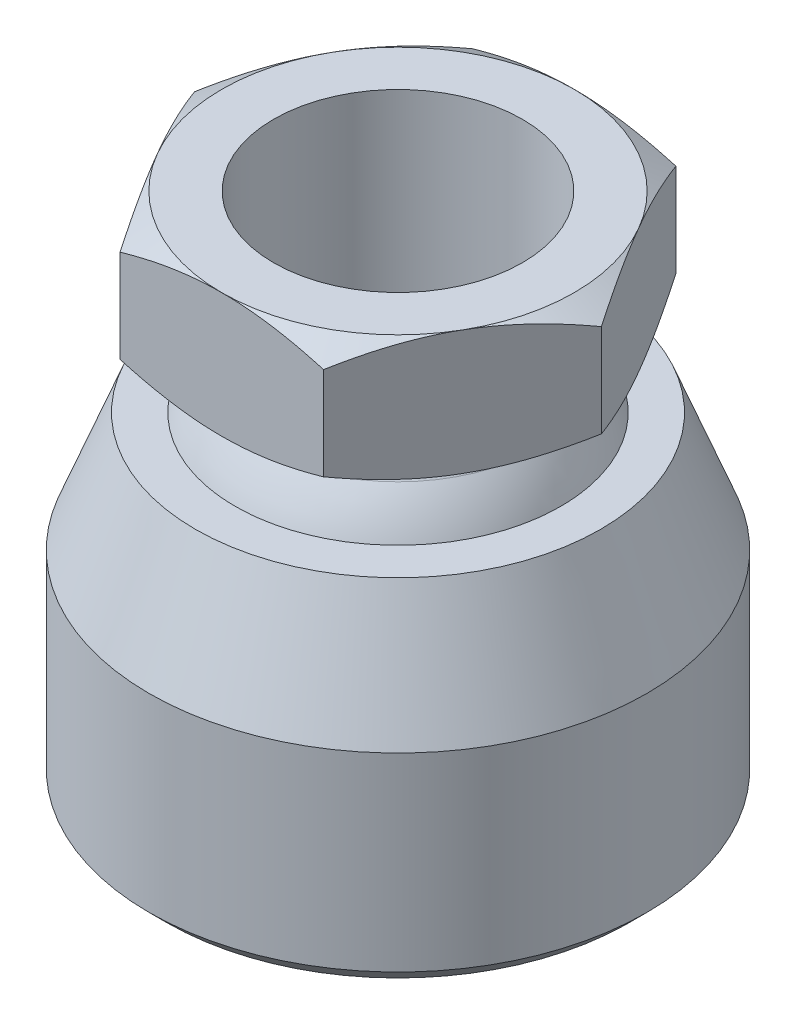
ISO-10303-21;
HEADER;
FILE_DESCRIPTION(('STEP AP214'),'2;1');
FILE_NAME('part.step','',(''),(''),'','','');
FILE_SCHEMA(('AUTOMOTIVE_DESIGN { 1 0 10303 214 1 1 1 1 }'));
ENDSEC;
DATA;
#1=APPLICATION_CONTEXT('core data for automotive mechanical design processes');
#2=APPLICATION_PROTOCOL_DEFINITION('international standard','automotive_design',2000,#1);
#3=PRODUCT_CONTEXT('',#1,'mechanical');
#4=PRODUCT('Part','Part','',(#3));
#5=PRODUCT_RELATED_PRODUCT_CATEGORY('part','',(#4));
#6=PRODUCT_DEFINITION_FORMATION('','',#4);
#7=PRODUCT_DEFINITION_CONTEXT('part definition',#1,'design');
#8=PRODUCT_DEFINITION('design','',#6,#7);
#9=PRODUCT_DEFINITION_SHAPE('','',#8);
#10=(LENGTH_UNIT() NAMED_UNIT(*) SI_UNIT(.MILLI.,.METRE.));
#11=(NAMED_UNIT(*) PLANE_ANGLE_UNIT() SI_UNIT($,.RADIAN.));
#12=(NAMED_UNIT(*) SI_UNIT($,.STERADIAN.) SOLID_ANGLE_UNIT());
#13=UNCERTAINTY_MEASURE_WITH_UNIT(LENGTH_MEASURE(1.E-05),#10,'distance_accuracy_value','');
#14=(GEOMETRIC_REPRESENTATION_CONTEXT(3) GLOBAL_UNCERTAINTY_ASSIGNED_CONTEXT((#13)) GLOBAL_UNIT_ASSIGNED_CONTEXT((#10,
#11,#12)) REPRESENTATION_CONTEXT('',''));
#15=CARTESIAN_POINT('',(0.,0.,0.));
#16=DIRECTION('',(0.,0.,1.));
#17=DIRECTION('',(1.,0.,0.));
#18=AXIS2_PLACEMENT_3D('',#15,#16,#17);
#19=CARTESIAN_POINT('',(0.,0.,0.));
#20=DIRECTION('',(-1.,0.,0.));
#21=DIRECTION('',(0.,1.,0.));
#22=AXIS2_PLACEMENT_3D('',#19,#20,#21);
#23=SPHERICAL_SURFACE('',#22,8.5);
#24=CARTESIAN_POINT('',(0.,0.,0.));
#25=DIRECTION('',(0.,-1.,0.));
#26=DIRECTION('',(0.,0.,-1.));
#27=AXIS2_PLACEMENT_3D('',#24,#25,#26);
#28=SPHERICAL_SURFACE('',#27,8.5);
#29=CARTESIAN_POINT('',(0.,5.13636363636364,0.));
#30=DIRECTION('',(0.,-1.,0.));
#31=DIRECTION('',(0.,0.,-1.));
#32=AXIS2_PLACEMENT_3D('',#29,#30,#31);
#33=CIRCLE('',#32,6.77257473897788);
#34=CARTESIAN_POINT('',(0.,5.13636363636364,-6.77257473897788));
#35=VERTEX_POINT('',#34);
#36=EDGE_CURVE('P0_E273',#35,#35,#33,.T.);
#37=ORIENTED_EDGE('',*,*,#36,.T.);
#38=EDGE_LOOP('',(#37));
#39=FACE_BOUND('',#38,.T.);
#40=ADVANCED_FACE('P0_F16',(#39),#28,.T.);
#41=CARTESIAN_POINT('',(-4.90747728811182,6.5,8.5));
#42=DIRECTION('',(0.,1.,0.));
#43=DIRECTION('',(0.,0.,1.));
#44=AXIS2_PLACEMENT_3D('',#41,#42,#43);
#45=PLANE('',#44);
#46=CARTESIAN_POINT('',(0.,6.5,0.));
#47=DIRECTION('',(0.,1.,0.));
#48=DIRECTION('',(0.,0.,1.));
#49=AXIS2_PLACEMENT_3D('',#46,#47,#48);
#50=CIRCLE('',#49,7.44983221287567);
#51=CARTESIAN_POINT('',(0.,6.5,7.44983221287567));
#52=VERTEX_POINT('',#51);
#53=EDGE_CURVE('P0_E270',#52,#52,#50,.T.);
#54=ORIENTED_EDGE('',*,*,#53,.T.);
#55=EDGE_LOOP('',(#54));
#56=FACE_BOUND('',#55,.T.);
#57=CARTESIAN_POINT('',(0.,6.5,0.));
#58=DIRECTION('',(0.,1.,0.));
#59=DIRECTION('',(0.,0.,1.));
#60=AXIS2_PLACEMENT_3D('',#57,#58,#59);
#61=CIRCLE('',#60,8.5);
#62=CARTESIAN_POINT('',(0.,6.5,8.5));
#63=VERTEX_POINT('',#62);
#64=CARTESIAN_POINT('',(7.36121593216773,6.5,4.25));
#65=VERTEX_POINT('',#64);
#66=EDGE_CURVE('P0_E317',#63,#65,#61,.T.);
#67=ORIENTED_EDGE('',*,*,#66,.F.);
#68=CARTESIAN_POINT('',(-7.36121593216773,6.5,4.25));
#69=VERTEX_POINT('',#68);
#70=EDGE_CURVE('P0_E322',#69,#63,#61,.T.);
#71=ORIENTED_EDGE('',*,*,#70,.F.);
#72=CARTESIAN_POINT('',(-7.36121593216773,6.5,-4.25));
#73=VERTEX_POINT('',#72);
#74=EDGE_CURVE('P0_E318',#73,#69,#61,.T.);
#75=ORIENTED_EDGE('',*,*,#74,.F.);
#76=CARTESIAN_POINT('',(0.,6.5,-8.5));
#77=VERTEX_POINT('',#76);
#78=EDGE_CURVE('P0_E36',#77,#73,#61,.T.);
#79=ORIENTED_EDGE('',*,*,#78,.F.);
#80=CARTESIAN_POINT('',(7.36121593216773,6.5,-4.25));
#81=VERTEX_POINT('',#80);
#82=EDGE_CURVE('P0_E44',#81,#77,#61,.T.);
#83=ORIENTED_EDGE('',*,*,#82,.F.);
#84=EDGE_CURVE('P0_E314',#65,#81,#61,.T.);
#85=ORIENTED_EDGE('',*,*,#84,.F.);
#86=EDGE_LOOP('',(#67,#71,#75,#79,#83,#85));
#87=FACE_BOUND('',#86,.T.);
#88=ADVANCED_FACE('P0_F132',(#56,#87),#45,.F.);
#89=CARTESIAN_POINT('',(0.,5.65,0.));
#90=DIRECTION('',(0.,1.,0.));
#91=DIRECTION('',(0.,0.,1.));
#92=AXIS2_PLACEMENT_3D('',#89,#90,#91);
#93=TOROIDAL_SURFACE('',#92,7.44983221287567,0.85);
#94=ORIENTED_EDGE('',*,*,#36,.F.);
#95=EDGE_LOOP('',(#94));
#96=FACE_BOUND('',#95,.T.);
#97=ORIENTED_EDGE('',*,*,#53,.F.);
#98=EDGE_LOOP('',(#97));
#99=FACE_BOUND('',#98,.T.);
#100=ADVANCED_FACE('P0_F18',(#96,#99),#93,.F.);
#101=CARTESIAN_POINT('',(0.,6.5,0.));
#102=DIRECTION('',(0.,1.,0.));
#103=DIRECTION('',(0.,0.,1.));
#104=AXIS2_PLACEMENT_3D('',#101,#102,#103);
#105=CONICAL_SURFACE('',#104,8.5,1.0471975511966);
#106=CARTESIAN_POINT('',(-4.90736181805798,7.25925604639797,8.5002));
#107=CARTESIAN_POINT('',(-5.01523349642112,7.19698613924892,8.31336077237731));
#108=CARTESIAN_POINT('',(-5.1235073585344,7.13754229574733,8.1258249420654));
#109=CARTESIAN_POINT('',(-5.34093440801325,7.02508511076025,7.74923024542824));
#110=CARTESIAN_POINT('',(-5.45008795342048,6.97207454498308,7.56017075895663));
#111=CARTESIAN_POINT('',(-5.77929626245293,6.82373338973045,6.9899652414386));
#112=CARTESIAN_POINT('',(-6.00065055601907,6.73935892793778,6.60656835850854));
#113=CARTESIAN_POINT('',(-6.33190297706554,6.64042001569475,6.03282233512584));
#114=CARTESIAN_POINT('',(-6.44081150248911,6.61223519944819,5.84418723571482));
#115=CARTESIAN_POINT('',(-6.65912106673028,6.5649740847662,5.46606397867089));
#116=CARTESIAN_POINT('',(-6.76852206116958,6.54589698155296,5.27657589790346));
#117=CARTESIAN_POINT('',(-6.98751241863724,6.5173347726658,4.8972734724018));
#118=CARTESIAN_POINT('',(-7.09710142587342,6.50783878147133,4.70745974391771));
#119=CARTESIAN_POINT('',(-7.31638067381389,6.49864237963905,4.32765694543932));
#120=CARTESIAN_POINT('',(-7.42607091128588,6.49894166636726,4.13766788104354));
#121=CARTESIAN_POINT('',(-7.63114046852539,6.50865447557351,3.78247698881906));
#122=CARTESIAN_POINT('',(-7.72653426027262,6.51688316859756,3.6172500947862));
#123=CARTESIAN_POINT('',(-7.9170984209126,6.5405892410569,3.28718328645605));
#124=CARTESIAN_POINT('',(-8.01226877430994,6.5560671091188,3.12234339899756));
#125=CARTESIAN_POINT('',(-8.29741139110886,6.61300862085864,2.62846189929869));
#126=CARTESIAN_POINT('',(-8.48687892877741,6.66497306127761,2.30029449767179));
#127=CARTESIAN_POINT('',(-8.86782383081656,6.79488494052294,1.64047857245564));
#128=CARTESIAN_POINT('',(-9.05925257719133,6.87338306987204,1.30891425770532));
#129=CARTESIAN_POINT('',(-9.43925537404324,7.05154133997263,0.650730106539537));
#130=CARTESIAN_POINT('',(-9.62783429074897,7.15115963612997,0.32410184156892));
#131=CARTESIAN_POINT('',(-9.81507004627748,7.25925604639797,-0.000200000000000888));
#132=B_SPLINE_CURVE_WITH_KNOTS('',3,(#106,#107,#108,#109,#110,#111,#112,#113,#114,#115,#116,
#117,#118,#119,#120,#121,#122,#123,#124,#125,#126,#127,#128,#129,#130,#131),.UNSPECIFIED.,.F.,
.F.,(4,2,2,2,2,2,2,2,2,2,2,2,4),(0.,0.673596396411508,1.34748239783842,2.69805431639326,
3.356799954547,4.01548737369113,4.67342558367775,5.33134346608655,5.90409556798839,
6.47688628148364,7.62328361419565,8.79510569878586,9.96462743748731),.UNSPECIFIED.);
#133=CARTESIAN_POINT('',(-4.90747728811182,7.25918937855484,8.5));
#134=VERTEX_POINT('',#133);
#135=EDGE_CURVE('P0_E167',#134,#69,#132,.T.);
#136=ORIENTED_EDGE('',*,*,#135,.T.);
#137=ORIENTED_EDGE('',*,*,#70,.T.);
#138=CARTESIAN_POINT('',(-13.3287339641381,10.7195001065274,8.5));
#139=CARTESIAN_POINT('',(-12.9562370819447,10.5382209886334,8.5));
#140=CARTESIAN_POINT('',(-12.58290072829,10.3586380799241,8.5));
#141=CARTESIAN_POINT('',(-11.8341032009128,10.0038157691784,8.5));
#142=CARTESIAN_POINT('',(-11.4586417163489,9.82857702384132,8.5));
#143=CARTESIAN_POINT('',(-10.7032828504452,9.48254356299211,8.5));
#144=CARTESIAN_POINT('',(-10.3233725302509,9.3117769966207,8.5));
#145=CARTESIAN_POINT('',(-9.56058129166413,8.97703859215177,8.5));
#146=CARTESIAN_POINT('',(-9.17770051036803,8.81306644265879,8.5));
#147=CARTESIAN_POINT('',(-8.39542942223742,8.48833842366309,8.5));
#148=CARTESIAN_POINT('',(-7.99591671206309,8.3278758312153,8.5));
#149=CARTESIAN_POINT('',(-7.19227261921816,8.01874365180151,8.5));
#150=CARTESIAN_POINT('',(-6.7881407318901,7.8700753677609,8.5));
#151=CARTESIAN_POINT('',(-5.97532072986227,7.58832803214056,8.5));
#152=CARTESIAN_POINT('',(-5.56664324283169,7.45521864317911,8.5));
#153=CARTESIAN_POINT('',(-4.74344164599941,7.20876184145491,8.5));
#154=CARTESIAN_POINT('',(-4.32891937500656,7.09540835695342,8.5));
#155=CARTESIAN_POINT('',(-3.49606577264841,6.89442587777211,8.5));
#156=CARTESIAN_POINT('',(-3.0777704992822,6.80665143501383,8.5));
#157=CARTESIAN_POINT('',(-2.44640359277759,6.697894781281,8.5));
#158=CARTESIAN_POINT('',(-2.23527946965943,6.6654586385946,8.5));
#159=CARTESIAN_POINT('',(-1.81193270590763,6.60885379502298,8.5));
#160=CARTESIAN_POINT('',(-1.59971017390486,6.58468429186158,8.5));
#161=CARTESIAN_POINT('',(-1.17728694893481,6.54540520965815,8.5));
#162=CARTESIAN_POINT('',(-0.967097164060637,6.5301788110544,8.5));
#163=CARTESIAN_POINT('',(-0.546261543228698,6.50863500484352,8.5));
#164=CARTESIAN_POINT('',(-0.335615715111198,6.50231744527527,8.5));
#165=CARTESIAN_POINT('',(0.0857542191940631,6.49874262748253,8.5));
#166=CARTESIAN_POINT('',(0.296478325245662,6.50148535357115,8.5));
#167=CARTESIAN_POINT('',(0.71761992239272,6.51596220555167,8.5));
#168=CARTESIAN_POINT('',(0.928037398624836,6.52769675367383,8.5));
#169=CARTESIAN_POINT('',(1.42936405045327,6.56611453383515,8.5));
#170=CARTESIAN_POINT('',(1.71997183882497,6.59682098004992,8.5));
#171=CARTESIAN_POINT('',(2.29911211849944,6.6737427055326,8.5));
#172=CARTESIAN_POINT('',(2.58764433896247,6.71995997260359,8.5));
#173=CARTESIAN_POINT('',(3.44975299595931,6.8794342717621,8.5));
#174=CARTESIAN_POINT('',(4.01953804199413,7.01348739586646,8.5));
#175=CARTESIAN_POINT('',(4.87169925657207,7.24698847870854,8.5));
#176=CARTESIAN_POINT('',(5.15846773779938,7.33133812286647,8.5));
#177=CARTESIAN_POINT('',(5.72922231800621,7.50906078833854,8.5));
#178=CARTESIAN_POINT('',(6.01320839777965,7.60243387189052,8.5));
#179=CARTESIAN_POINT('',(6.57848220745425,7.79668365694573,8.5));
#180=CARTESIAN_POINT('',(6.85977072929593,7.89755807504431,8.5));
#181=CARTESIAN_POINT('',(7.41999995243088,8.10559759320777,8.5));
#182=CARTESIAN_POINT('',(7.69894068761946,8.21276260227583,8.5));
#183=CARTESIAN_POINT('',(8.38072209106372,8.48211898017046,8.5));
#184=CARTESIAN_POINT('',(8.78240648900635,8.64723241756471,8.5));
#185=CARTESIAN_POINT('',(9.58213824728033,8.98607130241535,8.5));
#186=CARTESIAN_POINT('',(9.98018533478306,9.15979738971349,8.5));
#187=CARTESIAN_POINT('',(10.7733585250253,9.51405671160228,8.5));
#188=CARTESIAN_POINT('',(11.1684838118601,9.69459176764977,8.5));
#189=CARTESIAN_POINT('',(11.9562185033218,10.0610285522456,8.5));
#190=CARTESIAN_POINT('',(12.348827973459,10.2469301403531,8.5));
#191=CARTESIAN_POINT('',(13.132459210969,10.6232879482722,8.5));
#192=CARTESIAN_POINT('',(13.5234783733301,10.8137495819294,8.5));
#193=CARTESIAN_POINT('',(14.3037813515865,11.1981948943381,8.5));
#194=CARTESIAN_POINT('',(14.6930651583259,11.3921785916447,8.5));
#195=CARTESIAN_POINT('',(15.4701152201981,11.7830098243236,8.5));
#196=CARTESIAN_POINT('',(15.8578817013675,11.9798569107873,8.5));
#197=CARTESIAN_POINT('',(16.6321842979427,12.375957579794,8.5));
#198=CARTESIAN_POINT('',(17.0187204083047,12.5752111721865,8.5));
#199=CARTESIAN_POINT('',(18.107429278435,13.140012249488,8.5));
#200=CARTESIAN_POINT('',(18.8083971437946,13.5078820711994,8.5));
#201=CARTESIAN_POINT('',(20.2077532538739,14.2485558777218,8.5));
#202=CARTESIAN_POINT('',(20.9061413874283,14.6213600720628,8.49999999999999));
#203=CARTESIAN_POINT('',(22.2989609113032,15.3696602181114,8.49999999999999));
#204=CARTESIAN_POINT('',(22.9933979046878,15.7451457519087,8.49999999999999));
#205=CARTESIAN_POINT('',(24.380634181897,16.4990285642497,8.49999999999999));
#206=CARTESIAN_POINT('',(25.073433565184,16.8774256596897,8.49999999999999));
#207=CARTESIAN_POINT('',(25.7656380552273,17.2568995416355,8.49999999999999));
#208=B_SPLINE_CURVE_WITH_KNOTS('',3,(#138,#139,#140,#141,#142,#143,#144,#145,#146,#147,#148,
#149,#150,#151,#152,#153,#154,#155,#156,#157,#158,#159,#160,#161,#162,#163,#164,#165,#166,#167,
#168,#169,#170,#171,#172,#173,#174,#175,#176,#177,#178,#179,#180,#181,#182,#183,#184,#185,#186,
#187,#188,#189,#190,#191,#192,#193,#194,#195,#196,#197,#198,#199,#200,#201,#202,#203,#204,#205,
#206,#207),.UNSPECIFIED.,.F.,.F.,(4,2,2,2,2,2,2,2,2,2,2,2,2,2,2,2,2,2,2,2,2,2,2,2,2,2,2,2,2,2,2,
2,2,2,4),(0.,1.24281148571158,2.48580971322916,3.73533130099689,4.98479555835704,
6.27624989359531,7.56784669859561,8.85688153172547,10.1455194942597,11.4266802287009,
12.0673477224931,12.7079530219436,13.3399927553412,13.972021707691,14.6040495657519,
15.236107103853,16.1122916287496,16.988588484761,18.742091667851,19.638762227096,
20.5354389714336,21.431843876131,22.3282358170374,23.6309839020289,24.9338289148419,
26.2370249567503,27.5401869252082,28.8449813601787,30.1497826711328,31.4543815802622,
32.7589858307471,35.1338574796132,37.5088302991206,39.8771739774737,42.2453699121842),.UNSPECIFIED.);
#209=EDGE_CURVE('P0_E20',#63,#134,#208,.F.);
#210=ORIENTED_EDGE('',*,*,#209,.T.);
#211=EDGE_LOOP('',(#136,#137,#210));
#212=FACE_BOUND('',#211,.T.);
#213=ADVANCED_FACE('P0_F181',(#212),#105,.T.);
#214=CARTESIAN_POINT('',(9.81507004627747,7.25925604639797,-0.000199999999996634));
#215=CARTESIAN_POINT('',(9.70719836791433,7.19698613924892,0.186639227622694));
#216=CARTESIAN_POINT('',(9.59892450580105,7.13754229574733,0.3741750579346));
#217=CARTESIAN_POINT('',(9.3814974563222,7.02508511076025,0.750769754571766));
#218=CARTESIAN_POINT('',(9.27234391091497,6.97207454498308,0.93982924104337));
#219=CARTESIAN_POINT('',(8.94313560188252,6.82373338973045,1.5100347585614));
#220=CARTESIAN_POINT('',(8.72178130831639,6.73935892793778,1.89343164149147));
#221=CARTESIAN_POINT('',(8.39052888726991,6.64042001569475,2.46717766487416));
#222=CARTESIAN_POINT('',(8.28162036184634,6.61223519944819,2.65581276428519));
#223=CARTESIAN_POINT('',(8.06331079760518,6.5649740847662,3.03393602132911));
#224=CARTESIAN_POINT('',(7.95390980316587,6.54589698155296,3.22342410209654));
#225=CARTESIAN_POINT('',(7.73491944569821,6.5173347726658,3.6027265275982));
#226=CARTESIAN_POINT('',(7.62533043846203,6.50783878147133,3.79254025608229));
#227=CARTESIAN_POINT('',(7.40605119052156,6.49864237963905,4.17234305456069));
#228=CARTESIAN_POINT('',(7.29636095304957,6.49894166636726,4.36233211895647));
#229=CARTESIAN_POINT('',(7.09129139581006,6.50865447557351,4.71752301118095));
#230=CARTESIAN_POINT('',(6.99589760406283,6.51688316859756,4.8827499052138));
#231=CARTESIAN_POINT('',(6.80533344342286,6.54058924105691,5.21281671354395));
#232=CARTESIAN_POINT('',(6.71016309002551,6.5560671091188,5.37765660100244));
#233=CARTESIAN_POINT('',(6.42502047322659,6.61300862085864,5.87153810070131));
#234=CARTESIAN_POINT('',(6.23555293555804,6.66497306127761,6.19970550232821));
#235=CARTESIAN_POINT('',(5.8546080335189,6.79488494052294,6.85952142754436));
#236=CARTESIAN_POINT('',(5.66317928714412,6.87338306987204,7.19108574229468));
#237=CARTESIAN_POINT('',(5.28317649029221,7.05154133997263,7.84926989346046));
#238=CARTESIAN_POINT('',(5.09459757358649,7.15115963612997,8.17589815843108));
#239=CARTESIAN_POINT('',(4.90736181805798,7.25925604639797,8.5002));
#240=B_SPLINE_CURVE_WITH_KNOTS('',3,(#214,#215,#216,#217,#218,#219,#220,#221,#222,#223,#224,
#225,#226,#227,#228,#229,#230,#231,#232,#233,#234,#235,#236,#237,#238,#239),.UNSPECIFIED.,.F.,
.F.,(4,2,2,2,2,2,2,2,2,2,2,2,4),(0.,0.673596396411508,1.34748239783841,2.69805431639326,
3.356799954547,4.01548737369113,4.67342558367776,5.33134346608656,5.90409556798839,
6.47688628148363,7.62328361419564,8.79510569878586,9.96462743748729),.UNSPECIFIED.);
#241=CARTESIAN_POINT('',(4.90747728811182,7.25918937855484,8.5));
#242=VERTEX_POINT('',#241);
#243=EDGE_CURVE('P0_E189',#65,#242,#240,.T.);
#244=ORIENTED_EDGE('',*,*,#243,.T.);
#245=EDGE_CURVE('P0_E11',#242,#63,#208,.F.);
#246=ORIENTED_EDGE('',*,*,#245,.T.);
#247=ORIENTED_EDGE('',*,*,#66,.T.);
#248=EDGE_LOOP('',(#244,#246,#247));
#249=FACE_BOUND('',#248,.T.);
#250=ADVANCED_FACE('P0_F177',(#249),#105,.T.);
#251=CARTESIAN_POINT('',(4.90736181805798,7.25925604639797,-8.5002));
#252=CARTESIAN_POINT('',(5.01523349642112,7.19698613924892,-8.31336077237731));
#253=CARTESIAN_POINT('',(5.1235073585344,7.13754229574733,-8.1258249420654));
#254=CARTESIAN_POINT('',(5.34093440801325,7.02508511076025,-7.74923024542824));
#255=CARTESIAN_POINT('',(5.45008795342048,6.97207454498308,-7.56017075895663));
#256=CARTESIAN_POINT('',(5.77929626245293,6.82373338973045,-6.9899652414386));
#257=CARTESIAN_POINT('',(6.00065055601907,6.73935892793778,-6.60656835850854));
#258=CARTESIAN_POINT('',(6.33190297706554,6.64042001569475,-6.03282233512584));
#259=CARTESIAN_POINT('',(6.44081150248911,6.61223519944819,-5.84418723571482));
#260=CARTESIAN_POINT('',(6.65912106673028,6.5649740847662,-5.46606397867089));
#261=CARTESIAN_POINT('',(6.76852206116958,6.54589698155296,-5.27657589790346));
#262=CARTESIAN_POINT('',(6.98751241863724,6.5173347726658,-4.8972734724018));
#263=CARTESIAN_POINT('',(7.09710142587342,6.50783878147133,-4.70745974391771));
#264=CARTESIAN_POINT('',(7.31638067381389,6.49864237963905,-4.32765694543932));
#265=CARTESIAN_POINT('',(7.42607091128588,6.49894166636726,-4.13766788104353));
#266=CARTESIAN_POINT('',(7.63114046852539,6.5086544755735,-3.78247698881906));
#267=CARTESIAN_POINT('',(7.72653426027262,6.51688316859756,-3.6172500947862));
#268=CARTESIAN_POINT('',(7.9170984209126,6.5405892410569,-3.28718328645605));
#269=CARTESIAN_POINT('',(8.01226877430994,6.5560671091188,-3.12234339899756));
#270=CARTESIAN_POINT('',(8.29741139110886,6.61300862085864,-2.62846189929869));
#271=CARTESIAN_POINT('',(8.48687892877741,6.66497306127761,-2.30029449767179));
#272=CARTESIAN_POINT('',(8.86782383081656,6.79488494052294,-1.64047857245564));
#273=CARTESIAN_POINT('',(9.05925257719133,6.87338306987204,-1.30891425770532));
#274=CARTESIAN_POINT('',(9.43925537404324,7.05154133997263,-0.650730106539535));
#275=CARTESIAN_POINT('',(9.62783429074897,7.15115963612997,-0.324101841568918));
#276=CARTESIAN_POINT('',(9.81507004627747,7.25925604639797,0.000200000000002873));
#277=B_SPLINE_CURVE_WITH_KNOTS('',3,(#251,#252,#253,#254,#255,#256,#257,#258,#259,#260,#261,
#262,#263,#264,#265,#266,#267,#268,#269,#270,#271,#272,#273,#274,#275,#276),.UNSPECIFIED.,.F.,
.F.,(4,2,2,2,2,2,2,2,2,2,2,2,4),(0.,0.673596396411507,1.34748239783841,2.69805431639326,
3.356799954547,4.01548737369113,4.67342558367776,5.33134346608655,5.90409556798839,
6.47688628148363,7.62328361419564,8.79510569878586,9.96462743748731),.UNSPECIFIED.);
#278=CARTESIAN_POINT('',(9.81495457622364,7.25918937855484,0.));
#279=VERTEX_POINT('',#278);
#280=EDGE_CURVE('P0_E196',#81,#279,#277,.T.);
#281=ORIENTED_EDGE('',*,*,#280,.T.);
#282=EDGE_CURVE('P0_E304',#279,#65,#240,.T.);
#283=ORIENTED_EDGE('',*,*,#282,.T.);
#284=ORIENTED_EDGE('',*,*,#84,.T.);
#285=EDGE_LOOP('',(#281,#283,#284));
#286=FACE_BOUND('',#285,.T.);
#287=ADVANCED_FACE('P0_F180',(#286),#105,.T.);
#288=CARTESIAN_POINT('',(-13.3287339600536,10.7195001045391,-8.5));
#289=CARTESIAN_POINT('',(-12.9562370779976,10.538220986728,-8.5));
#290=CARTESIAN_POINT('',(-12.5829007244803,10.3586380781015,-8.5));
#291=CARTESIAN_POINT('',(-11.8341031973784,10.0038157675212,-8.5));
#292=CARTESIAN_POINT('',(-11.4586417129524,9.82857702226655,-8.5));
#293=CARTESIAN_POINT('',(-10.7032828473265,9.48254356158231,-8.5));
#294=CARTESIAN_POINT('',(-10.3233725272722,9.31177699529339,-8.5));
#295=CARTESIAN_POINT('',(-9.56058128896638,8.97703859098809,-8.5));
#296=CARTESIAN_POINT('',(-9.17770050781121,8.81306644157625,-8.5));
#297=CARTESIAN_POINT('',(-8.3954294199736,8.48833842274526,-8.5));
#298=CARTESIAN_POINT('',(-7.99591670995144,8.32787583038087,-8.5));
#299=CARTESIAN_POINT('',(-7.19227261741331,8.01874365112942,-8.5));
#300=CARTESIAN_POINT('',(-6.78814073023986,7.87007536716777,-8.5));
#301=CARTESIAN_POINT('',(-5.97532072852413,7.58832803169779,-8.5));
#302=CARTESIAN_POINT('',(-5.56664324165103,7.45521864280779,-8.5));
#303=CARTESIAN_POINT('',(-4.74344164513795,7.20876184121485,-8.5));
#304=CARTESIAN_POINT('',(-4.32891937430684,7.09540835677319,-8.5));
#305=CARTESIAN_POINT('',(-3.49606577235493,6.89442587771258,-8.5));
#306=CARTESIAN_POINT('',(-3.07777049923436,6.80665143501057,-8.5));
#307=CARTESIAN_POINT('',(-2.44640359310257,6.69789478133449,-8.5));
#308=CARTESIAN_POINT('',(-2.23527947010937,6.66545863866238,-8.5));
#309=CARTESIAN_POINT('',(-1.81193270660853,6.60885379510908,-8.5));
#310=CARTESIAN_POINT('',(-1.59971017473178,6.58468429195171,-8.5));
#311=CARTESIAN_POINT('',(-1.17728695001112,6.54540520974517,-8.5));
#312=CARTESIAN_POINT('',(-0.967097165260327,6.53017881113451,-8.5));
#313=CARTESIAN_POINT('',(-0.546261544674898,6.50863500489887,-8.5));
#314=CARTESIAN_POINT('',(-0.335615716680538,6.50231744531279,-8.5));
#315=CARTESIAN_POINT('',(0.0857542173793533,6.49874262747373,-8.5));
#316=CARTESIAN_POINT('',(0.296478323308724,6.50148535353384,-8.5));
#317=CARTESIAN_POINT('',(0.717619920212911,6.51596220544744,-8.5));
#318=CARTESIAN_POINT('',(0.928037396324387,6.52769675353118,-8.5));
#319=CARTESIAN_POINT('',(1.42936404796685,6.56611453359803,-8.5));
#320=CARTESIAN_POINT('',(1.71997183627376,6.59682097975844,-8.5));
#321=CARTESIAN_POINT('',(2.29911211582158,6.67374270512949,-8.5));
#322=CARTESIAN_POINT('',(2.58764433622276,6.71995997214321,-8.5));
#323=CARTESIAN_POINT('',(3.44975299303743,6.87943427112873,-8.5));
#324=CARTESIAN_POINT('',(4.0195380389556,7.01348739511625,-8.5));
#325=CARTESIAN_POINT('',(4.87169925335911,7.24698847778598,-8.5));
#326=CARTESIAN_POINT('',(5.15846773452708,7.33133812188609,-8.5));
#327=CARTESIAN_POINT('',(5.72922231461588,7.50906078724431,-8.5));
#328=CARTESIAN_POINT('',(6.01320839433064,7.60243387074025,-8.5));
#329=CARTESIAN_POINT('',(6.57848220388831,7.79668365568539,-8.5));
#330=CARTESIAN_POINT('',(6.85977072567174,7.89755807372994,-8.5));
#331=CARTESIAN_POINT('',(7.41999994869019,8.10559759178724,-8.5));
#332=CARTESIAN_POINT('',(7.69894068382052,8.21276260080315,-8.5));
#333=CARTESIAN_POINT('',(8.38072208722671,8.48211897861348,-8.5));
#334=CARTESIAN_POINT('',(8.78240648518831,8.64723241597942,-8.5));
#335=CARTESIAN_POINT('',(9.58213824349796,8.98607130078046,-8.5));
#336=CARTESIAN_POINT('',(9.9801853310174,9.15979738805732,-8.5));
#337=CARTESIAN_POINT('',(10.7733585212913,9.51405670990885,-8.5));
#338=CARTESIAN_POINT('',(11.1684838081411,9.69459176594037,-8.5));
#339=CARTESIAN_POINT('',(11.9562184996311,10.0610285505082,-8.5));
#340=CARTESIAN_POINT('',(12.3488279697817,10.2469301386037,-8.5));
#341=CARTESIAN_POINT('',(13.1324592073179,10.623287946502,-8.5));
#342=CARTESIAN_POINT('',(13.5234783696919,10.8137495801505,-8.5));
#343=CARTESIAN_POINT('',(14.3037813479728,11.1981948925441,-8.5));
#344=CARTESIAN_POINT('',(14.6930651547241,11.3921785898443,-8.5));
#345=CARTESIAN_POINT('',(15.4701152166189,11.7830098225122,-8.5));
#346=CARTESIAN_POINT('',(15.8578816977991,11.9798569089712,-8.5));
#347=CARTESIAN_POINT('',(16.6321842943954,12.37595757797,-8.5));
#348=CARTESIAN_POINT('',(17.0187204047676,12.5752111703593,-8.5));
#349=CARTESIAN_POINT('',(18.1074292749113,13.1400122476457,-8.5));
#350=CARTESIAN_POINT('',(18.8083971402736,13.5078820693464,-8.5));
#351=CARTESIAN_POINT('',(20.2077532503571,14.2485558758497,-8.5));
#352=CARTESIAN_POINT('',(20.9061413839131,14.6213600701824,-8.5));
#353=CARTESIAN_POINT('',(22.2989609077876,15.3696602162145,-8.5));
#354=CARTESIAN_POINT('',(22.9933979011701,15.7451457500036,-8.5));
#355=CARTESIAN_POINT('',(24.3806341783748,16.4990285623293,-8.5));
#356=CARTESIAN_POINT('',(25.0734335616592,16.8774256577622,-8.5));
#357=CARTESIAN_POINT('',(25.7656380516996,17.2568995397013,-8.5));
#358=B_SPLINE_CURVE_WITH_KNOTS('',3,(#288,#289,#290,#291,#292,#293,#294,#295,#296,#297,#298,
#299,#300,#301,#302,#303,#304,#305,#306,#307,#308,#309,#310,#311,#312,#313,#314,#315,#316,#317,
#318,#319,#320,#321,#322,#323,#324,#325,#326,#327,#328,#329,#330,#331,#332,#333,#334,#335,#336,
#337,#338,#339,#340,#341,#342,#343,#344,#345,#346,#347,#348,#349,#350,#351,#352,#353,#354,#355,
#356,#357),.UNSPECIFIED.,.F.,.F.,(4,2,2,2,2,2,2,2,2,2,2,2,2,2,2,2,2,2,2,2,2,2,2,2,2,2,2,2,2,2,2,
2,2,2,4),(0.,1.24281148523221,2.48580971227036,3.73533129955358,4.98479555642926,
6.27624989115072,7.56784669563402,8.85688152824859,10.1455194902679,11.4266802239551,
12.0673477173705,12.7079530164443,13.3399927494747,13.9720217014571,14.6040495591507,
15.2361070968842,16.1122916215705,16.9885884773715,18.7420916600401,19.6387622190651,
20.535438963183,21.4318438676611,22.3282358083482,23.6309838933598,24.9338289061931,
26.2370249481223,27.5401869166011,28.8449813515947,30.1497826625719,31.454381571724,
32.7589858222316,35.1338574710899,37.5088302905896,39.8771739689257,42.2453699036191),.UNSPECIFIED.);
#359=CARTESIAN_POINT('',(4.90747728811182,7.25918937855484,-8.5));
#360=VERTEX_POINT('',#359);
#361=EDGE_CURVE('P0_E201',#77,#360,#358,.T.);
#362=ORIENTED_EDGE('',*,*,#361,.T.);
#363=EDGE_CURVE('P0_E207',#360,#81,#277,.T.);
#364=ORIENTED_EDGE('',*,*,#363,.T.);
#365=ORIENTED_EDGE('',*,*,#82,.T.);
#366=EDGE_LOOP('',(#362,#364,#365));
#367=FACE_BOUND('',#366,.T.);
#368=ADVANCED_FACE('P0_F310',(#367),#105,.T.);
#369=CARTESIAN_POINT('',(-9.81507004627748,7.25925604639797,0.000199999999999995));
#370=CARTESIAN_POINT('',(-9.70719836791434,7.19698613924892,-0.186639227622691));
#371=CARTESIAN_POINT('',(-9.59892450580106,7.13754229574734,-0.374175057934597));
#372=CARTESIAN_POINT('',(-9.3814974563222,7.02508511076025,-0.750769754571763));
#373=CARTESIAN_POINT('',(-9.27234391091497,6.97207454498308,-0.939829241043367));
#374=CARTESIAN_POINT('',(-8.94313560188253,6.82373338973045,-1.5100347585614));
#375=CARTESIAN_POINT('',(-8.72178130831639,6.73935892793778,-1.89343164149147));
#376=CARTESIAN_POINT('',(-8.39052888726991,6.64042001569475,-2.46717766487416));
#377=CARTESIAN_POINT('',(-8.28162036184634,6.61223519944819,-2.65581276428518));
#378=CARTESIAN_POINT('',(-8.06331079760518,6.5649740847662,-3.03393602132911));
#379=CARTESIAN_POINT('',(-7.95390980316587,6.54589698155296,-3.22342410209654));
#380=CARTESIAN_POINT('',(-7.73491944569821,6.5173347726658,-3.6027265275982));
#381=CARTESIAN_POINT('',(-7.62533043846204,6.50783878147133,-3.79254025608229));
#382=CARTESIAN_POINT('',(-7.40605119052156,6.49864237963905,-4.17234305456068));
#383=CARTESIAN_POINT('',(-7.29636095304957,6.49894166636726,-4.36233211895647));
#384=CARTESIAN_POINT('',(-7.09129139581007,6.50865447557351,-4.71752301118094));
#385=CARTESIAN_POINT('',(-6.99589760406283,6.51688316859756,-4.8827499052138));
#386=CARTESIAN_POINT('',(-6.80533344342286,6.54058924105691,-5.21281671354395));
#387=CARTESIAN_POINT('',(-6.71016309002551,6.5560671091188,-5.37765660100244));
#388=CARTESIAN_POINT('',(-6.42502047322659,6.61300862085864,-5.87153810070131));
#389=CARTESIAN_POINT('',(-6.23555293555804,6.66497306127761,-6.19970550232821));
#390=CARTESIAN_POINT('',(-5.8546080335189,6.79488494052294,-6.85952142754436));
#391=CARTESIAN_POINT('',(-5.66317928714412,6.87338306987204,-7.19108574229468));
#392=CARTESIAN_POINT('',(-5.28317649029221,7.05154133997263,-7.84926989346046));
#393=CARTESIAN_POINT('',(-5.09459757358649,7.15115963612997,-8.17589815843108));
#394=CARTESIAN_POINT('',(-4.90736181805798,7.25925604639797,-8.5002));
#395=B_SPLINE_CURVE_WITH_KNOTS('',3,(#369,#370,#371,#372,#373,#374,#375,#376,#377,#378,#379,
#380,#381,#382,#383,#384,#385,#386,#387,#388,#389,#390,#391,#392,#393,#394),.UNSPECIFIED.,.F.,
.F.,(4,2,2,2,2,2,2,2,2,2,2,2,4),(0.,0.673596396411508,1.34748239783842,2.69805431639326,
3.356799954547,4.01548737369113,4.67342558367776,5.33134346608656,5.9040955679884,
6.47688628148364,7.62328361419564,8.79510569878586,9.96462743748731),.UNSPECIFIED.);
#396=CARTESIAN_POINT('',(-4.90747728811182,7.25918937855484,-8.5));
#397=VERTEX_POINT('',#396);
#398=EDGE_CURVE('P0_E169',#73,#397,#395,.T.);
#399=ORIENTED_EDGE('',*,*,#398,.T.);
#400=EDGE_CURVE('P0_E206',#397,#77,#358,.T.);
#401=ORIENTED_EDGE('',*,*,#400,.T.);
#402=ORIENTED_EDGE('',*,*,#78,.T.);
#403=EDGE_LOOP('',(#399,#401,#402));
#404=FACE_BOUND('',#403,.T.);
#405=ADVANCED_FACE('P0_F437',(#404),#105,.T.);
#406=CARTESIAN_POINT('',(-9.81495457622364,7.25918937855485,0.));
#407=VERTEX_POINT('',#406);
#408=EDGE_CURVE('P0_E161',#69,#407,#132,.T.);
#409=ORIENTED_EDGE('',*,*,#408,.T.);
#410=EDGE_CURVE('P0_E168',#407,#73,#395,.T.);
#411=ORIENTED_EDGE('',*,*,#410,.T.);
#412=ORIENTED_EDGE('',*,*,#74,.T.);
#413=EDGE_LOOP('',(#409,#411,#412));
#414=FACE_BOUND('',#413,.T.);
#415=ADVANCED_FACE('P0_F341',(#414),#105,.T.);
#416=CARTESIAN_POINT('',(-4.90747728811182,6.5,8.5));
#417=DIRECTION('',(0.,0.,1.));
#418=DIRECTION('',(1.,0.,0.));
#419=AXIS2_PLACEMENT_3D('',#416,#417,#418);
#420=PLANE('',#419);
#421=CARTESIAN_POINT('',(-13.3287339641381,8.28049989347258,8.5));
#422=CARTESIAN_POINT('',(-12.9562370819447,8.46177901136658,8.5));
#423=CARTESIAN_POINT('',(-12.58290072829,8.64136192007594,8.5));
#424=CARTESIAN_POINT('',(-11.8341032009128,8.99618423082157,8.5));
#425=CARTESIAN_POINT('',(-11.4586417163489,9.17142297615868,8.5));
#426=CARTESIAN_POINT('',(-10.7032828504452,9.51745643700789,8.5));
#427=CARTESIAN_POINT('',(-10.3233725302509,9.6882230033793,8.5));
#428=CARTESIAN_POINT('',(-9.56058129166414,10.0229614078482,8.5));
#429=CARTESIAN_POINT('',(-9.17770051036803,10.1869335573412,8.5));
#430=CARTESIAN_POINT('',(-8.39542942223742,10.5116615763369,8.5));
#431=CARTESIAN_POINT('',(-7.99591671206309,10.6721241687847,8.5));
#432=CARTESIAN_POINT('',(-7.19227261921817,10.9812563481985,8.5));
#433=CARTESIAN_POINT('',(-6.7881407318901,11.1299246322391,8.5));
#434=CARTESIAN_POINT('',(-5.97532072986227,11.4116719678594,8.5));
#435=CARTESIAN_POINT('',(-5.5666432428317,11.5447813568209,8.5));
#436=CARTESIAN_POINT('',(-4.74344164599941,11.7912381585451,8.5));
#437=CARTESIAN_POINT('',(-4.32891937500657,11.9045916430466,8.5));
#438=CARTESIAN_POINT('',(-3.49606577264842,12.1055741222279,8.5));
#439=CARTESIAN_POINT('',(-3.07777049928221,12.1933485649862,8.5));
#440=CARTESIAN_POINT('',(-2.44640359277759,12.302105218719,8.5));
#441=CARTESIAN_POINT('',(-2.23527946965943,12.3345413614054,8.5));
#442=CARTESIAN_POINT('',(-1.81193270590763,12.391146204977,8.5));
#443=CARTESIAN_POINT('',(-1.59971017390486,12.4153157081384,8.5));
#444=CARTESIAN_POINT('',(-1.17728694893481,12.4545947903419,8.5));
#445=CARTESIAN_POINT('',(-0.967097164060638,12.4698211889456,8.5));
#446=CARTESIAN_POINT('',(-0.546261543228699,12.4913649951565,8.5));
#447=CARTESIAN_POINT('',(-0.335615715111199,12.4976825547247,8.5));
#448=CARTESIAN_POINT('',(0.085754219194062,12.5012573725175,8.5));
#449=CARTESIAN_POINT('',(0.296478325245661,12.4985146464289,8.5));
#450=CARTESIAN_POINT('',(0.717619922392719,12.4840377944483,8.5));
#451=CARTESIAN_POINT('',(0.928037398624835,12.4723032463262,8.5));
#452=CARTESIAN_POINT('',(1.42936405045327,12.4338854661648,8.5));
#453=CARTESIAN_POINT('',(1.71997183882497,12.4031790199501,8.5));
#454=CARTESIAN_POINT('',(2.29911211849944,12.3262572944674,8.5));
#455=CARTESIAN_POINT('',(2.58764433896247,12.2800400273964,8.5));
#456=CARTESIAN_POINT('',(3.44975299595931,12.1205657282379,8.5));
#457=CARTESIAN_POINT('',(4.01953804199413,11.9865126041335,8.5));
#458=CARTESIAN_POINT('',(4.87169925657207,11.7530115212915,8.5));
#459=CARTESIAN_POINT('',(5.15846773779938,11.6686618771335,8.5));
#460=CARTESIAN_POINT('',(5.72922231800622,11.4909392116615,8.5));
#461=CARTESIAN_POINT('',(6.01320839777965,11.3975661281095,8.5));
#462=CARTESIAN_POINT('',(6.57848220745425,11.2033163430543,8.5));
#463=CARTESIAN_POINT('',(6.85977072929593,11.1024419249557,8.5));
#464=CARTESIAN_POINT('',(7.41999995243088,10.8944024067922,8.5));
#465=CARTESIAN_POINT('',(7.69894068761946,10.7872373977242,8.5));
#466=CARTESIAN_POINT('',(8.38072209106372,10.5178810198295,8.5));
#467=CARTESIAN_POINT('',(8.78240648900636,10.3527675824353,8.5));
#468=CARTESIAN_POINT('',(9.58213824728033,10.0139286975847,8.5));
#469=CARTESIAN_POINT('',(9.98018533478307,9.84020261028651,8.5));
#470=CARTESIAN_POINT('',(10.7733585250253,9.48594328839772,8.5));
#471=CARTESIAN_POINT('',(11.1684838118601,9.30540823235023,8.5));
#472=CARTESIAN_POINT('',(11.9562185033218,8.93897144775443,8.5));
#473=CARTESIAN_POINT('',(12.348827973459,8.75306985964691,8.5));
#474=CARTESIAN_POINT('',(13.132459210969,8.37671205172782,8.5));
#475=CARTESIAN_POINT('',(13.5234783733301,8.18625041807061,8.5));
#476=CARTESIAN_POINT('',(14.3037813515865,7.8018051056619,8.5));
#477=CARTESIAN_POINT('',(14.6930651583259,7.60782140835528,8.5));
#478=CARTESIAN_POINT('',(15.4701152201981,7.21699017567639,8.5));
#479=CARTESIAN_POINT('',(15.8578817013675,7.02014308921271,8.5));
#480=CARTESIAN_POINT('',(16.6321842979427,6.62404242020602,8.5));
#481=CARTESIAN_POINT('',(17.0187204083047,6.42478882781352,8.5));
#482=CARTESIAN_POINT('',(18.107429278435,5.85998775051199,8.5));
#483=CARTESIAN_POINT('',(18.8083971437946,5.49211792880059,8.5));
#484=CARTESIAN_POINT('',(20.2077532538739,4.75144412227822,8.5));
#485=CARTESIAN_POINT('',(20.9061413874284,4.3786399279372,8.49999999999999));
#486=CARTESIAN_POINT('',(22.2989609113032,3.63033978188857,8.49999999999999));
#487=CARTESIAN_POINT('',(22.9933979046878,3.25485424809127,8.49999999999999));
#488=CARTESIAN_POINT('',(24.380634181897,2.50097143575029,8.49999999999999));
#489=CARTESIAN_POINT('',(25.073433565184,2.12257434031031,8.49999999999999));
#490=CARTESIAN_POINT('',(25.7656380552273,1.74310045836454,8.49999999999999));
#491=B_SPLINE_CURVE_WITH_KNOTS('',3,(#421,#422,#423,#424,#425,#426,#427,#428,#429,#430,#431,
#432,#433,#434,#435,#436,#437,#438,#439,#440,#441,#442,#443,#444,#445,#446,#447,#448,#449,#450,
#451,#452,#453,#454,#455,#456,#457,#458,#459,#460,#461,#462,#463,#464,#465,#466,#467,#468,#469,
#470,#471,#472,#473,#474,#475,#476,#477,#478,#479,#480,#481,#482,#483,#484,#485,#486,#487,#488,
#489,#490),.UNSPECIFIED.,.F.,.F.,(4,2,2,2,2,2,2,2,2,2,2,2,2,2,2,2,2,2,2,2,2,2,2,2,2,2,2,2,2,2,2,
2,2,2,4),(0.,1.24281148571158,2.48580971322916,3.73533130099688,4.98479555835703,
6.27624989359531,7.56784669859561,8.85688153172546,10.1455194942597,11.4266802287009,
12.0673477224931,12.7079530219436,13.3399927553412,13.972021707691,14.6040495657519,
15.236107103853,16.1122916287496,16.988588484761,18.742091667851,19.638762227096,
20.5354389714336,21.431843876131,22.3282358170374,23.6309839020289,24.9338289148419,
26.2370249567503,27.5401869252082,28.8449813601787,30.1497826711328,31.4543815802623,
32.7589858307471,35.1338574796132,37.5088302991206,39.8771739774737,42.2453699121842),.UNSPECIFIED.);
#492=CARTESIAN_POINT('',(-4.90747728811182,11.7408106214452,8.5));
#493=VERTEX_POINT('',#492);
#494=CARTESIAN_POINT('',(0.,12.5,8.5));
#495=VERTEX_POINT('',#494);
#496=EDGE_CURVE('P0_E327',#493,#495,#491,.T.);
#497=ORIENTED_EDGE('',*,*,#496,.F.);
#498=DIRECTION('',(0.,1.,0.));
#499=VECTOR('',#498,1.);
#500=CARTESIAN_POINT('',(-4.90747728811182,6.5,8.5));
#501=LINE('',#500,#499);
#502=EDGE_CURVE('P0_E286',#134,#493,#501,.T.);
#503=ORIENTED_EDGE('',*,*,#502,.F.);
#504=ORIENTED_EDGE('',*,*,#209,.F.);
#505=ORIENTED_EDGE('',*,*,#245,.F.);
#506=DIRECTION('',(0.,1.,0.));
#507=VECTOR('',#506,1.);
#508=CARTESIAN_POINT('',(4.90747728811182,6.5,8.5));
#509=LINE('',#508,#507);
#510=CARTESIAN_POINT('',(4.90747728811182,11.7408106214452,8.5));
#511=VERTEX_POINT('',#510);
#512=EDGE_CURVE('P0_E283',#242,#511,#509,.T.);
#513=ORIENTED_EDGE('',*,*,#512,.T.);
#514=EDGE_CURVE('P0_E321',#495,#511,#491,.T.);
#515=ORIENTED_EDGE('',*,*,#514,.F.);
#516=EDGE_LOOP('',(#497,#503,#504,#505,#513,#515));
#517=FACE_BOUND('',#516,.T.);
#518=ADVANCED_FACE('P0_F148',(#517),#420,.T.);
#519=CARTESIAN_POINT('',(4.90747728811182,6.5,8.5));
#520=DIRECTION('',(0.866025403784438,0.,0.5));
#521=DIRECTION('',(0.5,0.,-0.866025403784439));
#522=AXIS2_PLACEMENT_3D('',#519,#520,#521);
#523=PLANE('',#522);
#524=CARTESIAN_POINT('',(4.90736181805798,11.740743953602,8.5002));
#525=CARTESIAN_POINT('',(5.01523349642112,11.8030138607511,8.31336077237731));
#526=CARTESIAN_POINT('',(5.1235073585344,11.8624577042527,8.1258249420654));
#527=CARTESIAN_POINT('',(5.34093440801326,11.9749148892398,7.74923024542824));
#528=CARTESIAN_POINT('',(5.45008795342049,12.0279254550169,7.56017075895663));
#529=CARTESIAN_POINT('',(5.77929626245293,12.1762666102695,6.9899652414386));
#530=CARTESIAN_POINT('',(6.00065055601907,12.2606410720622,6.60656835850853));
#531=CARTESIAN_POINT('',(6.33190297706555,12.3595799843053,6.03282233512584));
#532=CARTESIAN_POINT('',(6.44081150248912,12.3877648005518,5.84418723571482));
#533=CARTESIAN_POINT('',(6.65912106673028,12.4350259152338,5.46606397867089));
#534=CARTESIAN_POINT('',(6.76852206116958,12.454103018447,5.27657589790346));
#535=CARTESIAN_POINT('',(6.98751241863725,12.4826652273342,4.8972734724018));
#536=CARTESIAN_POINT('',(7.09710142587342,12.4921612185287,4.70745974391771));
#537=CARTESIAN_POINT('',(7.3163806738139,12.5013576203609,4.32765694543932));
#538=CARTESIAN_POINT('',(7.42607091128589,12.5010583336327,4.13766788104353));
#539=CARTESIAN_POINT('',(7.63114046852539,12.4913455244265,3.78247698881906));
#540=CARTESIAN_POINT('',(7.72653426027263,12.4831168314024,3.6172500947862));
#541=CARTESIAN_POINT('',(7.9170984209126,12.4594107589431,3.28718328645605));
#542=CARTESIAN_POINT('',(8.01226877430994,12.4439328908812,3.12234339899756));
#543=CARTESIAN_POINT('',(8.29741139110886,12.3869913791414,2.62846189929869));
#544=CARTESIAN_POINT('',(8.48687892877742,12.3350269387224,2.30029449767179));
#545=CARTESIAN_POINT('',(8.86782383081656,12.2051150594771,1.64047857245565));
#546=CARTESIAN_POINT('',(9.05925257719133,12.126616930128,1.30891425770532));
#547=CARTESIAN_POINT('',(9.43925537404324,11.9484586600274,0.65073010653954));
#548=CARTESIAN_POINT('',(9.62783429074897,11.84884036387,0.324101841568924));
#549=CARTESIAN_POINT('',(9.81507004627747,11.740743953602,-0.000199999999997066));
#550=B_SPLINE_CURVE_WITH_KNOTS('',3,(#524,#525,#526,#527,#528,#529,#530,#531,#532,#533,#534,
#535,#536,#537,#538,#539,#540,#541,#542,#543,#544,#545,#546,#547,#548,#549),.UNSPECIFIED.,.F.,
.F.,(4,2,2,2,2,2,2,2,2,2,2,2,4),(0.,0.673596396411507,1.34748239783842,2.69805431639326,
3.356799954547,4.01548737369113,4.67342558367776,5.33134346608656,5.90409556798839,
6.47688628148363,7.62328361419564,8.79510569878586,9.9646274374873),.UNSPECIFIED.);
#551=CARTESIAN_POINT('',(7.36121593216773,12.5,4.25));
#552=VERTEX_POINT('',#551);
#553=EDGE_CURVE('P0_E237',#511,#552,#550,.T.);
#554=ORIENTED_EDGE('',*,*,#553,.F.);
#555=ORIENTED_EDGE('',*,*,#512,.F.);
#556=ORIENTED_EDGE('',*,*,#243,.F.);
#557=ORIENTED_EDGE('',*,*,#282,.F.);
#558=DIRECTION('',(0.,1.,0.));
#559=VECTOR('',#558,1.);
#560=CARTESIAN_POINT('',(9.81495457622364,6.5,0.));
#561=LINE('',#560,#559);
#562=CARTESIAN_POINT('',(9.81495457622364,11.7408106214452,0.));
#563=VERTEX_POINT('',#562);
#564=EDGE_CURVE('P0_E278',#279,#563,#561,.T.);
#565=ORIENTED_EDGE('',*,*,#564,.T.);
#566=EDGE_CURVE('P0_E232',#552,#563,#550,.T.);
#567=ORIENTED_EDGE('',*,*,#566,.F.);
#568=EDGE_LOOP('',(#554,#555,#556,#557,#565,#567));
#569=FACE_BOUND('',#568,.T.);
#570=ADVANCED_FACE('P0_F331',(#569),#523,.T.);
#571=CARTESIAN_POINT('',(9.81495457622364,6.5,0.));
#572=DIRECTION('',(0.866025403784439,0.,-0.5));
#573=DIRECTION('',(-0.5,0.,-0.866025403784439));
#574=AXIS2_PLACEMENT_3D('',#571,#572,#573);
#575=PLANE('',#574);
#576=CARTESIAN_POINT('',(9.81507004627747,11.740743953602,0.000200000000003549));
#577=CARTESIAN_POINT('',(9.70719836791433,11.8030138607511,-0.186639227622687));
#578=CARTESIAN_POINT('',(9.59892450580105,11.8624577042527,-0.374175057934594));
#579=CARTESIAN_POINT('',(9.3814974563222,11.9749148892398,-0.75076975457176));
#580=CARTESIAN_POINT('',(9.27234391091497,12.0279254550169,-0.939829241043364));
#581=CARTESIAN_POINT('',(8.94313560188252,12.1762666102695,-1.5100347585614));
#582=CARTESIAN_POINT('',(8.72178130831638,12.2606410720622,-1.89343164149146));
#583=CARTESIAN_POINT('',(8.39052888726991,12.3595799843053,-2.46717766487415));
#584=CARTESIAN_POINT('',(8.28162036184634,12.3877648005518,-2.65581276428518));
#585=CARTESIAN_POINT('',(8.06331079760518,12.4350259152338,-3.0339360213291));
#586=CARTESIAN_POINT('',(7.95390980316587,12.454103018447,-3.22342410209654));
#587=CARTESIAN_POINT('',(7.73491944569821,12.4826652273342,-3.6027265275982));
#588=CARTESIAN_POINT('',(7.62533043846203,12.4921612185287,-3.79254025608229));
#589=CARTESIAN_POINT('',(7.40605119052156,12.5013576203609,-4.17234305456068));
#590=CARTESIAN_POINT('',(7.29636095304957,12.5010583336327,-4.36233211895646));
#591=CARTESIAN_POINT('',(7.09129139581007,12.4913455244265,-4.71752301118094));
#592=CARTESIAN_POINT('',(6.99589760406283,12.4831168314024,-4.8827499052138));
#593=CARTESIAN_POINT('',(6.80533344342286,12.4594107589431,-5.21281671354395));
#594=CARTESIAN_POINT('',(6.71016309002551,12.4439328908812,-5.37765660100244));
#595=CARTESIAN_POINT('',(6.42502047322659,12.3869913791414,-5.87153810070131));
#596=CARTESIAN_POINT('',(6.23555293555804,12.3350269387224,-6.19970550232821));
#597=CARTESIAN_POINT('',(5.8546080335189,12.2051150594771,-6.85952142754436));
#598=CARTESIAN_POINT('',(5.66317928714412,12.126616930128,-7.19108574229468));
#599=CARTESIAN_POINT('',(5.28317649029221,11.9484586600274,-7.84926989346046));
#600=CARTESIAN_POINT('',(5.09459757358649,11.84884036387,-8.17589815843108));
#601=CARTESIAN_POINT('',(4.90736181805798,11.740743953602,-8.5002));
#602=B_SPLINE_CURVE_WITH_KNOTS('',3,(#576,#577,#578,#579,#580,#581,#582,#583,#584,#585,#586,
#587,#588,#589,#590,#591,#592,#593,#594,#595,#596,#597,#598,#599,#600,#601),.UNSPECIFIED.,.F.,
.F.,(4,2,2,2,2,2,2,2,2,2,2,2,4),(0.,0.673596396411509,1.34748239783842,2.69805431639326,
3.356799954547,4.01548737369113,4.67342558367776,5.33134346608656,5.9040955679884,
6.47688628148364,7.62328361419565,8.79510569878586,9.96462743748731),.UNSPECIFIED.);
#603=CARTESIAN_POINT('',(7.36121593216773,12.5,-4.25));
#604=VERTEX_POINT('',#603);
#605=EDGE_CURVE('P0_E228',#563,#604,#602,.T.);
#606=ORIENTED_EDGE('',*,*,#605,.F.);
#607=ORIENTED_EDGE('',*,*,#564,.F.);
#608=ORIENTED_EDGE('',*,*,#280,.F.);
#609=ORIENTED_EDGE('',*,*,#363,.F.);
#610=DIRECTION('',(0.,1.,0.));
#611=VECTOR('',#610,1.);
#612=CARTESIAN_POINT('',(4.90747728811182,6.5,-8.5));
#613=LINE('',#612,#611);
#614=CARTESIAN_POINT('',(4.90747728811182,11.7408106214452,-8.5));
#615=VERTEX_POINT('',#614);
#616=EDGE_CURVE('P0_E275',#360,#615,#613,.T.);
#617=ORIENTED_EDGE('',*,*,#616,.T.);
#618=EDGE_CURVE('P0_E222',#604,#615,#602,.T.);
#619=ORIENTED_EDGE('',*,*,#618,.F.);
#620=EDGE_LOOP('',(#606,#607,#608,#609,#617,#619));
#621=FACE_BOUND('',#620,.T.);
#622=ADVANCED_FACE('P0_F211',(#621),#575,.T.);
#623=CARTESIAN_POINT('',(4.90747728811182,6.5,-8.5));
#624=DIRECTION('',(0.,0.,-1.));
#625=DIRECTION('',(-1.,0.,0.));
#626=AXIS2_PLACEMENT_3D('',#623,#624,#625);
#627=PLANE('',#626);
#628=CARTESIAN_POINT('',(-13.3287339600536,8.28049989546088,-8.5));
#629=CARTESIAN_POINT('',(-12.9562370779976,8.46177901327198,-8.5));
#630=CARTESIAN_POINT('',(-12.5829007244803,8.64136192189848,-8.5));
#631=CARTESIAN_POINT('',(-11.8341031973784,8.9961842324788,-8.5));
#632=CARTESIAN_POINT('',(-11.4586417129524,9.17142297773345,-8.5));
#633=CARTESIAN_POINT('',(-10.7032828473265,9.5174564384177,-8.5));
#634=CARTESIAN_POINT('',(-10.3233725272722,9.68822300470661,-8.5));
#635=CARTESIAN_POINT('',(-9.56058128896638,10.0229614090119,-8.5));
#636=CARTESIAN_POINT('',(-9.1777005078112,10.1869335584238,-8.5));
#637=CARTESIAN_POINT('',(-8.3954294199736,10.5116615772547,-8.5));
#638=CARTESIAN_POINT('',(-7.99591670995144,10.6721241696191,-8.5));
#639=CARTESIAN_POINT('',(-7.1922726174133,10.9812563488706,-8.5));
#640=CARTESIAN_POINT('',(-6.78814073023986,11.1299246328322,-8.5));
#641=CARTESIAN_POINT('',(-5.97532072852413,11.4116719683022,-8.5));
#642=CARTESIAN_POINT('',(-5.56664324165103,11.5447813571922,-8.5));
#643=CARTESIAN_POINT('',(-4.74344164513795,11.7912381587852,-8.5));
#644=CARTESIAN_POINT('',(-4.32891937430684,11.9045916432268,-8.5));
#645=CARTESIAN_POINT('',(-3.49606577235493,12.1055741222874,-8.5));
#646=CARTESIAN_POINT('',(-3.07777049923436,12.1933485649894,-8.5));
#647=CARTESIAN_POINT('',(-2.44640359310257,12.3021052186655,-8.5));
#648=CARTESIAN_POINT('',(-2.23527947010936,12.3345413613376,-8.5));
#649=CARTESIAN_POINT('',(-1.81193270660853,12.3911462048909,-8.5));
#650=CARTESIAN_POINT('',(-1.59971017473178,12.4153157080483,-8.5));
#651=CARTESIAN_POINT('',(-1.17728695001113,12.4545947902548,-8.5));
#652=CARTESIAN_POINT('',(-0.967097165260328,12.4698211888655,-8.5));
#653=CARTESIAN_POINT('',(-0.546261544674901,12.4913649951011,-8.5));
#654=CARTESIAN_POINT('',(-0.33561571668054,12.4976825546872,-8.5));
#655=CARTESIAN_POINT('',(0.0857542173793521,12.5012573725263,-8.5));
#656=CARTESIAN_POINT('',(0.296478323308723,12.4985146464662,-8.5));
#657=CARTESIAN_POINT('',(0.717619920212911,12.4840377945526,-8.5));
#658=CARTESIAN_POINT('',(0.928037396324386,12.4723032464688,-8.5));
#659=CARTESIAN_POINT('',(1.42936404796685,12.433885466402,-8.5));
#660=CARTESIAN_POINT('',(1.71997183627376,12.4031790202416,-8.5));
#661=CARTESIAN_POINT('',(2.29911211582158,12.3262572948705,-8.5));
#662=CARTESIAN_POINT('',(2.58764433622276,12.2800400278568,-8.5));
#663=CARTESIAN_POINT('',(3.44975299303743,12.1205657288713,-8.5));
#664=CARTESIAN_POINT('',(4.0195380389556,11.9865126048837,-8.5));
#665=CARTESIAN_POINT('',(4.87169925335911,11.753011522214,-8.5));
#666=CARTESIAN_POINT('',(5.15846773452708,11.6686618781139,-8.5));
#667=CARTESIAN_POINT('',(5.72922231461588,11.4909392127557,-8.5));
#668=CARTESIAN_POINT('',(6.01320839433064,11.3975661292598,-8.5));
#669=CARTESIAN_POINT('',(6.57848220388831,11.2033163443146,-8.5));
#670=CARTESIAN_POINT('',(6.85977072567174,11.1024419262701,-8.5));
#671=CARTESIAN_POINT('',(7.41999994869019,10.8944024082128,-8.5));
#672=CARTESIAN_POINT('',(7.69894068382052,10.7872373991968,-8.5));
#673=CARTESIAN_POINT('',(8.38072208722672,10.5178810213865,-8.5));
#674=CARTESIAN_POINT('',(8.78240648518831,10.3527675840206,-8.5));
#675=CARTESIAN_POINT('',(9.58213824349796,10.0139286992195,-8.5));
#676=CARTESIAN_POINT('',(9.9801853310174,9.84020261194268,-8.5));
#677=CARTESIAN_POINT('',(10.7733585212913,9.48594329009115,-8.5));
#678=CARTESIAN_POINT('',(11.1684838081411,9.30540823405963,-8.5));
#679=CARTESIAN_POINT('',(11.9562184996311,8.93897144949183,-8.5));
#680=CARTESIAN_POINT('',(12.3488279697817,8.75306986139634,-8.5));
#681=CARTESIAN_POINT('',(13.1324592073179,8.37671205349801,-8.5));
#682=CARTESIAN_POINT('',(13.5234783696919,8.18625041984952,-8.5));
#683=CARTESIAN_POINT('',(14.3037813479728,7.80180510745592,-8.5));
#684=CARTESIAN_POINT('',(14.6930651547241,7.60782141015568,-8.5));
#685=CARTESIAN_POINT('',(15.4701152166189,7.21699017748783,-8.5));
#686=CARTESIAN_POINT('',(15.8578816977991,7.0201430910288,-8.5));
#687=CARTESIAN_POINT('',(16.6321842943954,6.62404242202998,-8.5));
#688=CARTESIAN_POINT('',(17.0187204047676,6.42478882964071,-8.5));
#689=CARTESIAN_POINT('',(18.1074292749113,5.85998775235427,-8.5));
#690=CARTESIAN_POINT('',(18.8083971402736,5.49211793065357,-8.5));
#691=CARTESIAN_POINT('',(20.2077532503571,4.75144412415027,-8.5));
#692=CARTESIAN_POINT('',(20.9061413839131,4.37863992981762,-8.5));
#693=CARTESIAN_POINT('',(22.2989609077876,3.63033978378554,-8.5));
#694=CARTESIAN_POINT('',(22.9933979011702,3.25485424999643,-8.5));
#695=CARTESIAN_POINT('',(24.3806341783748,2.50097143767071,-8.5));
#696=CARTESIAN_POINT('',(25.0734335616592,2.1225743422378,-8.5));
#697=CARTESIAN_POINT('',(25.7656380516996,1.74310046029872,-8.5));
#698=B_SPLINE_CURVE_WITH_KNOTS('',3,(#628,#629,#630,#631,#632,#633,#634,#635,#636,#637,#638,
#639,#640,#641,#642,#643,#644,#645,#646,#647,#648,#649,#650,#651,#652,#653,#654,#655,#656,#657,
#658,#659,#660,#661,#662,#663,#664,#665,#666,#667,#668,#669,#670,#671,#672,#673,#674,#675,#676,
#677,#678,#679,#680,#681,#682,#683,#684,#685,#686,#687,#688,#689,#690,#691,#692,#693,#694,#695,
#696,#697),.UNSPECIFIED.,.F.,.F.,(4,2,2,2,2,2,2,2,2,2,2,2,2,2,2,2,2,2,2,2,2,2,2,2,2,2,2,2,2,2,2,
2,2,2,4),(0.,1.24281148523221,2.48580971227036,3.73533129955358,4.98479555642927,
6.27624989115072,7.56784669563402,8.85688152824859,10.1455194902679,11.4266802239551,
12.0673477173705,12.7079530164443,13.3399927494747,13.9720217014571,14.6040495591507,
15.2361070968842,16.1122916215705,16.9885884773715,18.7420916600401,19.6387622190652,
20.535438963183,21.4318438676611,22.3282358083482,23.6309838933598,24.9338289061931,
26.2370249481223,27.5401869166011,28.8449813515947,30.1497826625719,31.454381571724,
32.7589858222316,35.1338574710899,37.5088302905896,39.8771739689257,42.2453699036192),.UNSPECIFIED.);
#699=CARTESIAN_POINT('',(0.,12.5,-8.5));
#700=VERTEX_POINT('',#699);
#701=EDGE_CURVE('P0_E221',#615,#700,#698,.F.);
#702=ORIENTED_EDGE('',*,*,#701,.F.);
#703=ORIENTED_EDGE('',*,*,#616,.F.);
#704=ORIENTED_EDGE('',*,*,#361,.F.);
#705=ORIENTED_EDGE('',*,*,#400,.F.);
#706=DIRECTION('',(0.,1.,0.));
#707=VECTOR('',#706,1.);
#708=CARTESIAN_POINT('',(-4.90747728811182,6.5,-8.5));
#709=LINE('',#708,#707);
#710=CARTESIAN_POINT('',(-4.90747728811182,11.7408106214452,-8.5));
#711=VERTEX_POINT('',#710);
#712=EDGE_CURVE('P0_E271',#397,#711,#709,.T.);
#713=ORIENTED_EDGE('',*,*,#712,.T.);
#714=EDGE_CURVE('P0_E216',#700,#711,#698,.F.);
#715=ORIENTED_EDGE('',*,*,#714,.F.);
#716=EDGE_LOOP('',(#702,#703,#704,#705,#713,#715));
#717=FACE_BOUND('',#716,.T.);
#718=ADVANCED_FACE('P0_F208',(#717),#627,.T.);
#719=CARTESIAN_POINT('',(-4.90747728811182,6.5,-8.5));
#720=DIRECTION('',(-0.866025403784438,0.,-0.5));
#721=DIRECTION('',(-0.5,0.,0.866025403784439));
#722=AXIS2_PLACEMENT_3D('',#719,#720,#721);
#723=PLANE('',#722);
#724=CARTESIAN_POINT('',(-4.90736181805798,11.740743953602,-8.5002));
#725=CARTESIAN_POINT('',(-5.01523349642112,11.8030138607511,-8.31336077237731));
#726=CARTESIAN_POINT('',(-5.1235073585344,11.8624577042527,-8.1258249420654));
#727=CARTESIAN_POINT('',(-5.34093440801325,11.9749148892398,-7.74923024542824));
#728=CARTESIAN_POINT('',(-5.45008795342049,12.0279254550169,-7.56017075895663));
#729=CARTESIAN_POINT('',(-5.77929626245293,12.1762666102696,-6.9899652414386));
#730=CARTESIAN_POINT('',(-6.00065055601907,12.2606410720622,-6.60656835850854));
#731=CARTESIAN_POINT('',(-6.33190297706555,12.3595799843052,-6.03282233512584));
#732=CARTESIAN_POINT('',(-6.44081150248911,12.3877648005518,-5.84418723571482));
#733=CARTESIAN_POINT('',(-6.65912106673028,12.4350259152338,-5.46606397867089));
#734=CARTESIAN_POINT('',(-6.76852206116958,12.454103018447,-5.27657589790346));
#735=CARTESIAN_POINT('',(-6.98751241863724,12.4826652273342,-4.8972734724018));
#736=CARTESIAN_POINT('',(-7.09710142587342,12.4921612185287,-4.70745974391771));
#737=CARTESIAN_POINT('',(-7.31638067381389,12.5013576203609,-4.32765694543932));
#738=CARTESIAN_POINT('',(-7.42607091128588,12.5010583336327,-4.13766788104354));
#739=CARTESIAN_POINT('',(-7.63114046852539,12.4913455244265,-3.78247698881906));
#740=CARTESIAN_POINT('',(-7.72653426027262,12.4831168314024,-3.6172500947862));
#741=CARTESIAN_POINT('',(-7.9170984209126,12.4594107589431,-3.28718328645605));
#742=CARTESIAN_POINT('',(-8.01226877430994,12.4439328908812,-3.12234339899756));
#743=CARTESIAN_POINT('',(-8.29741139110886,12.3869913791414,-2.62846189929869));
#744=CARTESIAN_POINT('',(-8.48687892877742,12.3350269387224,-2.30029449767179));
#745=CARTESIAN_POINT('',(-8.86782383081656,12.2051150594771,-1.64047857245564));
#746=CARTESIAN_POINT('',(-9.05925257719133,12.126616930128,-1.30891425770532));
#747=CARTESIAN_POINT('',(-9.43925537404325,11.9484586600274,-0.650730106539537));
#748=CARTESIAN_POINT('',(-9.62783429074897,11.84884036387,-0.32410184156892));
#749=CARTESIAN_POINT('',(-9.81507004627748,11.740743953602,0.00020000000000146));
#750=B_SPLINE_CURVE_WITH_KNOTS('',3,(#724,#725,#726,#727,#728,#729,#730,#731,#732,#733,#734,
#735,#736,#737,#738,#739,#740,#741,#742,#743,#744,#745,#746,#747,#748,#749),.UNSPECIFIED.,.F.,
.F.,(4,2,2,2,2,2,2,2,2,2,2,2,4),(0.,0.673596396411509,1.34748239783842,2.69805431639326,
3.356799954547,4.01548737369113,4.67342558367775,5.33134346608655,5.90409556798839,
6.47688628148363,7.62328361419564,8.79510569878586,9.9646274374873),.UNSPECIFIED.);
#751=CARTESIAN_POINT('',(-7.36121593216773,12.5,-4.25));
#752=VERTEX_POINT('',#751);
#753=EDGE_CURVE('P0_E227',#711,#752,#750,.T.);
#754=ORIENTED_EDGE('',*,*,#753,.F.);
#755=ORIENTED_EDGE('',*,*,#712,.F.);
#756=ORIENTED_EDGE('',*,*,#398,.F.);
#757=ORIENTED_EDGE('',*,*,#410,.F.);
#758=DIRECTION('',(0.,1.,0.));
#759=VECTOR('',#758,1.);
#760=CARTESIAN_POINT('',(-9.81495457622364,6.5,0.));
#761=LINE('',#760,#759);
#762=CARTESIAN_POINT('',(-9.81495457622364,11.7408106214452,0.));
#763=VERTEX_POINT('',#762);
#764=EDGE_CURVE('P0_E175',#407,#763,#761,.T.);
#765=ORIENTED_EDGE('',*,*,#764,.T.);
#766=EDGE_CURVE('P0_E223',#752,#763,#750,.T.);
#767=ORIENTED_EDGE('',*,*,#766,.F.);
#768=EDGE_LOOP('',(#754,#755,#756,#757,#765,#767));
#769=FACE_BOUND('',#768,.T.);
#770=ADVANCED_FACE('P0_F146',(#769),#723,.T.);
#771=CARTESIAN_POINT('',(-9.81495457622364,6.5,0.));
#772=DIRECTION('',(-0.866025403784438,0.,0.5));
#773=DIRECTION('',(0.5,0.,0.866025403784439));
#774=AXIS2_PLACEMENT_3D('',#771,#772,#773);
#775=PLANE('',#774);
#776=CARTESIAN_POINT('',(-9.81507004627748,11.740743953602,-0.000200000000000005));
#777=CARTESIAN_POINT('',(-9.70719836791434,11.8030138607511,0.186639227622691));
#778=CARTESIAN_POINT('',(-9.59892450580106,11.8624577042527,0.374175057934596));
#779=CARTESIAN_POINT('',(-9.3814974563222,11.9749148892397,0.750769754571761));
#780=CARTESIAN_POINT('',(-9.27234391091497,12.0279254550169,0.939829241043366));
#781=CARTESIAN_POINT('',(-8.94313560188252,12.1762666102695,1.5100347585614));
#782=CARTESIAN_POINT('',(-8.72178130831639,12.2606410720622,1.89343164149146));
#783=CARTESIAN_POINT('',(-8.39052888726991,12.3595799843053,2.46717766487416));
#784=CARTESIAN_POINT('',(-8.28162036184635,12.3877648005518,2.65581276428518));
#785=CARTESIAN_POINT('',(-8.06331079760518,12.4350259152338,3.03393602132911));
#786=CARTESIAN_POINT('',(-7.95390980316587,12.454103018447,3.22342410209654));
#787=CARTESIAN_POINT('',(-7.73491944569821,12.4826652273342,3.6027265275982));
#788=CARTESIAN_POINT('',(-7.62533043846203,12.4921612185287,3.79254025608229));
#789=CARTESIAN_POINT('',(-7.40605119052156,12.5013576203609,4.17234305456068));
#790=CARTESIAN_POINT('',(-7.29636095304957,12.5010583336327,4.36233211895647));
#791=CARTESIAN_POINT('',(-7.09129139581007,12.4913455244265,4.71752301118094));
#792=CARTESIAN_POINT('',(-6.99589760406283,12.4831168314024,4.8827499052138));
#793=CARTESIAN_POINT('',(-6.80533344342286,12.4594107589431,5.21281671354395));
#794=CARTESIAN_POINT('',(-6.71016309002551,12.4439328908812,5.37765660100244));
#795=CARTESIAN_POINT('',(-6.42502047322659,12.3869913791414,5.87153810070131));
#796=CARTESIAN_POINT('',(-6.23555293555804,12.3350269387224,6.19970550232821));
#797=CARTESIAN_POINT('',(-5.85460803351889,12.2051150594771,6.85952142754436));
#798=CARTESIAN_POINT('',(-5.66317928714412,12.126616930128,7.19108574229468));
#799=CARTESIAN_POINT('',(-5.28317649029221,11.9484586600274,7.84926989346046));
#800=CARTESIAN_POINT('',(-5.09459757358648,11.84884036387,8.17589815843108));
#801=CARTESIAN_POINT('',(-4.90736181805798,11.740743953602,8.5002));
#802=B_SPLINE_CURVE_WITH_KNOTS('',3,(#776,#777,#778,#779,#780,#781,#782,#783,#784,#785,#786,
#787,#788,#789,#790,#791,#792,#793,#794,#795,#796,#797,#798,#799,#800,#801),.UNSPECIFIED.,.F.,
.F.,(4,2,2,2,2,2,2,2,2,2,2,2,4),(0.,0.673596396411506,1.34748239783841,2.69805431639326,
3.35679995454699,4.01548737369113,4.67342558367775,5.33134346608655,5.90409556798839,
6.47688628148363,7.62328361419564,8.79510569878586,9.9646274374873),.UNSPECIFIED.);
#803=CARTESIAN_POINT('',(-7.36121593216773,12.5,4.25));
#804=VERTEX_POINT('',#803);
#805=EDGE_CURVE('P0_E236',#763,#804,#802,.T.);
#806=ORIENTED_EDGE('',*,*,#805,.F.);
#807=ORIENTED_EDGE('',*,*,#764,.F.);
#808=ORIENTED_EDGE('',*,*,#408,.F.);
#809=ORIENTED_EDGE('',*,*,#135,.F.);
#810=ORIENTED_EDGE('',*,*,#502,.T.);
#811=EDGE_CURVE('P0_E153',#804,#493,#802,.T.);
#812=ORIENTED_EDGE('',*,*,#811,.F.);
#813=EDGE_LOOP('',(#806,#807,#808,#809,#810,#812));
#814=FACE_BOUND('',#813,.T.);
#815=ADVANCED_FACE('P0_F142',(#814),#775,.T.);
#816=CARTESIAN_POINT('',(0.,9.5,0.));
#817=DIRECTION('',(0.,-1.,0.));
#818=DIRECTION('',(0.,0.,-1.));
#819=AXIS2_PLACEMENT_3D('',#816,#817,#818);
#820=CONICAL_SURFACE('',#819,13.6961524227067,1.0471975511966);
#821=ORIENTED_EDGE('',*,*,#553,.T.);
#822=CARTESIAN_POINT('',(0.,12.5,0.));
#823=DIRECTION('',(0.,1.,0.));
#824=DIRECTION('',(0.,0.,1.));
#825=AXIS2_PLACEMENT_3D('',#822,#823,#824);
#826=CIRCLE('',#825,8.5);
#827=EDGE_CURVE('P0_E296',#495,#552,#826,.T.);
#828=ORIENTED_EDGE('',*,*,#827,.F.);
#829=ORIENTED_EDGE('',*,*,#514,.T.);
#830=EDGE_LOOP('',(#821,#828,#829));
#831=FACE_BOUND('',#830,.T.);
#832=ADVANCED_FACE('P0_F145',(#831),#820,.T.);
#833=ORIENTED_EDGE('',*,*,#605,.T.);
#834=CARTESIAN_POINT('',(0.,12.5,0.));
#835=DIRECTION('',(0.,1.,0.));
#836=DIRECTION('',(0.,0.,1.));
#837=AXIS2_PLACEMENT_3D('',#834,#835,#836);
#838=CIRCLE('',#837,8.5);
#839=EDGE_CURVE('P0_E289',#604,#552,#838,.F.);
#840=ORIENTED_EDGE('',*,*,#839,.T.);
#841=ORIENTED_EDGE('',*,*,#566,.T.);
#842=EDGE_LOOP('',(#833,#840,#841));
#843=FACE_BOUND('',#842,.T.);
#844=ADVANCED_FACE('P0_F467',(#843),#820,.T.);
#845=ORIENTED_EDGE('',*,*,#701,.T.);
#846=EDGE_CURVE('P0_E264',#700,#604,#838,.F.);
#847=ORIENTED_EDGE('',*,*,#846,.T.);
#848=ORIENTED_EDGE('',*,*,#618,.T.);
#849=EDGE_LOOP('',(#845,#847,#848));
#850=FACE_BOUND('',#849,.T.);
#851=ADVANCED_FACE('P0_F293',(#850),#820,.T.);
#852=ORIENTED_EDGE('',*,*,#714,.T.);
#853=ORIENTED_EDGE('',*,*,#753,.T.);
#854=EDGE_CURVE('P0_E247',#752,#700,#838,.F.);
#855=ORIENTED_EDGE('',*,*,#854,.T.);
#856=EDGE_LOOP('',(#852,#853,#855));
#857=FACE_BOUND('',#856,.T.);
#858=ADVANCED_FACE('P0_F245',(#857),#820,.T.);
#859=ORIENTED_EDGE('',*,*,#766,.T.);
#860=ORIENTED_EDGE('',*,*,#805,.T.);
#861=EDGE_CURVE('P0_E256',#804,#752,#838,.F.);
#862=ORIENTED_EDGE('',*,*,#861,.T.);
#863=EDGE_LOOP('',(#859,#860,#862));
#864=FACE_BOUND('',#863,.T.);
#865=ADVANCED_FACE('P0_F257',(#864),#820,.T.);
#866=ORIENTED_EDGE('',*,*,#811,.T.);
#867=ORIENTED_EDGE('',*,*,#496,.T.);
#868=EDGE_CURVE('P0_E262',#495,#804,#838,.F.);
#869=ORIENTED_EDGE('',*,*,#868,.T.);
#870=EDGE_LOOP('',(#866,#867,#869));
#871=FACE_BOUND('',#870,.T.);
#872=ADVANCED_FACE('P0_F127',(#871),#820,.T.);
#873=CARTESIAN_POINT('',(-4.90747728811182,12.5,8.5));
#874=DIRECTION('',(0.,1.,0.));
#875=DIRECTION('',(0.,0.,1.));
#876=AXIS2_PLACEMENT_3D('',#873,#874,#875);
#877=PLANE('',#876);
#878=CARTESIAN_POINT('',(0.,12.5,0.));
#879=DIRECTION('',(0.,-1.,0.));
#880=DIRECTION('',(0.,0.,-1.));
#881=AXIS2_PLACEMENT_3D('',#878,#879,#880);
#882=CIRCLE('',#881,6.);
#883=CARTESIAN_POINT('',(0.,12.5,-6.));
#884=VERTEX_POINT('',#883);
#885=EDGE_CURVE('P0_E353',#884,#884,#882,.T.);
#886=ORIENTED_EDGE('',*,*,#885,.T.);
#887=EDGE_LOOP('',(#886));
#888=FACE_BOUND('',#887,.T.);
#889=ORIENTED_EDGE('',*,*,#868,.F.);
#890=ORIENTED_EDGE('',*,*,#827,.T.);
#891=ORIENTED_EDGE('',*,*,#839,.F.);
#892=ORIENTED_EDGE('',*,*,#846,.F.);
#893=ORIENTED_EDGE('',*,*,#854,.F.);
#894=ORIENTED_EDGE('',*,*,#861,.F.);
#895=EDGE_LOOP('',(#889,#890,#891,#892,#893,#894));
#896=FACE_BOUND('',#895,.T.);
#897=ADVANCED_FACE('P0_F115',(#888,#896),#877,.T.);
#898=CARTESIAN_POINT('',(0.,-5.5,0.));
#899=DIRECTION('',(0.,1.,0.));
#900=DIRECTION('',(0.,0.,1.));
#901=AXIS2_PLACEMENT_3D('',#898,#899,#900);
#902=CONICAL_SURFACE('',#901,0.,1.04719755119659);
#903=CARTESIAN_POINT('',(0.,-2.55551362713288,0.));
#904=DIRECTION('',(0.,-1.,0.));
#905=DIRECTION('',(0.,0.,-1.));
#906=AXIS2_PLACEMENT_3D('',#903,#904,#905);
#907=CIRCLE('',#906,5.1);
#908=CARTESIAN_POINT('',(0.,-2.55551362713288,-5.1));
#909=VERTEX_POINT('',#908);
#910=EDGE_CURVE('P0_E363',#909,#909,#907,.T.);
#911=ORIENTED_EDGE('',*,*,#910,.F.);
#912=EDGE_LOOP('',(#911));
#913=FACE_BOUND('',#912,.T.);
#914=CARTESIAN_POINT('',(0.,-5.5,0.));
#915=VERTEX_POINT('',#914);
#916=VERTEX_LOOP('',#915);
#917=FACE_BOUND('',#916,.T.);
#918=ADVANCED_FACE('P0_F112',(#913,#917),#902,.F.);
#919=CARTESIAN_POINT('',(0.,0.,0.));
#920=DIRECTION('',(0.,-1.,0.));
#921=DIRECTION('',(0.,0.,-1.));
#922=AXIS2_PLACEMENT_3D('',#919,#920,#921);
#923=CYLINDRICAL_SURFACE('',#922,6.);
#924=ORIENTED_EDGE('',*,*,#885,.F.);
#925=EDGE_LOOP('',(#924));
#926=FACE_BOUND('',#925,.T.);
#927=CARTESIAN_POINT('',(0.,0.5,0.));
#928=DIRECTION('',(0.,-1.,0.));
#929=DIRECTION('',(0.,0.,-1.));
#930=AXIS2_PLACEMENT_3D('',#927,#928,#929);
#931=CIRCLE('',#930,6.);
#932=CARTESIAN_POINT('',(0.,0.5,-6.));
#933=VERTEX_POINT('',#932);
#934=EDGE_CURVE('P0_E355',#933,#933,#931,.T.);
#935=ORIENTED_EDGE('',*,*,#934,.T.);
#936=EDGE_LOOP('',(#935));
#937=FACE_BOUND('',#936,.T.);
#938=ADVANCED_FACE('P0_F114',(#926,#937),#923,.F.);
#939=CARTESIAN_POINT('',(6.,0.5,0.));
#940=DIRECTION('',(0.,-1.,0.));
#941=DIRECTION('',(0.,0.,-1.));
#942=AXIS2_PLACEMENT_3D('',#939,#940,#941);
#943=PLANE('',#942);
#944=ORIENTED_EDGE('',*,*,#934,.F.);
#945=EDGE_LOOP('',(#944));
#946=FACE_BOUND('',#945,.T.);
#947=CARTESIAN_POINT('',(0.,0.5,0.));
#948=DIRECTION('',(0.,-1.,0.));
#949=DIRECTION('',(0.,0.,-1.));
#950=AXIS2_PLACEMENT_3D('',#947,#948,#949);
#951=CIRCLE('',#950,5.1);
#952=CARTESIAN_POINT('',(0.,0.5,-5.1));
#953=VERTEX_POINT('',#952);
#954=EDGE_CURVE('P0_E358',#953,#953,#951,.T.);
#955=ORIENTED_EDGE('',*,*,#954,.T.);
#956=EDGE_LOOP('',(#955));
#957=FACE_BOUND('',#956,.T.);
#958=ADVANCED_FACE('P0_F124',(#946,#957),#943,.F.);
#959=CARTESIAN_POINT('',(0.,0.,0.));
#960=DIRECTION('',(0.,-1.,0.));
#961=DIRECTION('',(0.,0.,-1.));
#962=AXIS2_PLACEMENT_3D('',#959,#960,#961);
#963=CYLINDRICAL_SURFACE('',#962,5.1);
#964=ORIENTED_EDGE('',*,*,#954,.F.);
#965=EDGE_LOOP('',(#964));
#966=FACE_BOUND('',#965,.T.);
#967=ORIENTED_EDGE('',*,*,#910,.T.);
#968=EDGE_LOOP('',(#967));
#969=FACE_BOUND('',#968,.T.);
#970=ADVANCED_FACE('P0_F366',(#966,#969),#963,.F.);
#971=CLOSED_SHELL('',(#40,#88,#100,#213,#250,#287,#368,#405,#415,#518,#570,#622,#718,#770,#815,
#832,#844,#851,#858,#865,#872,#897,#918,#938,#958,#970));
#972=MANIFOLD_SOLID_BREP('P0_B1',#971);
#973=CARTESIAN_POINT('',(0.,3.25,0.));
#974=DIRECTION('',(0.,-1.,0.));
#975=DIRECTION('',(0.,0.,-1.));
#976=AXIS2_PLACEMENT_3D('',#973,#974,#975);
#977=CYLINDRICAL_SURFACE('',#976,12.);
#978=CARTESIAN_POINT('',(0.,-11.65,0.));
#979=DIRECTION('',(0.,1.,0.));
#980=DIRECTION('',(0.,0.,1.));
#981=AXIS2_PLACEMENT_3D('',#978,#979,#980);
#982=CIRCLE('',#981,12.);
#983=CARTESIAN_POINT('',(0.,-11.65,12.));
#984=VERTEX_POINT('',#983);
#985=EDGE_CURVE('P1_E20',#984,#984,#982,.T.);
#986=ORIENTED_EDGE('',*,*,#985,.T.);
#987=EDGE_LOOP('',(#986));
#988=FACE_BOUND('',#987,.T.);
#989=CARTESIAN_POINT('',(0.,-2.5,0.));
#990=DIRECTION('',(0.,1.,0.));
#991=DIRECTION('',(0.,0.,1.));
#992=AXIS2_PLACEMENT_3D('',#989,#990,#991);
#993=CIRCLE('',#992,12.);
#994=CARTESIAN_POINT('',(0.,-2.5,12.));
#995=VERTEX_POINT('',#994);
#996=EDGE_CURVE('P1_E33',#995,#995,#993,.T.);
#997=ORIENTED_EDGE('',*,*,#996,.F.);
#998=EDGE_LOOP('',(#997));
#999=FACE_BOUND('',#998,.T.);
#1000=ADVANCED_FACE('P1_F13',(#988,#999),#977,.T.);
#1001=CARTESIAN_POINT('',(0.,-12.5,0.));
#1002=DIRECTION('',(0.,1.,0.));
#1003=DIRECTION('',(0.,0.,1.));
#1004=AXIS2_PLACEMENT_3D('',#1001,#1002,#1003);
#1005=PLANE('',#1004);
#1006=CARTESIAN_POINT('',(0.,-12.5,0.));
#1007=DIRECTION('',(0.,1.,0.));
#1008=DIRECTION('',(0.,0.,1.));
#1009=AXIS2_PLACEMENT_3D('',#1006,#1007,#1008);
#1010=CIRCLE('',#1009,11.15);
#1011=CARTESIAN_POINT('',(0.,-12.5,11.15));
#1012=VERTEX_POINT('',#1011);
#1013=EDGE_CURVE('P1_E9',#1012,#1012,#1010,.F.);
#1014=ORIENTED_EDGE('',*,*,#1013,.T.);
#1015=EDGE_LOOP('',(#1014));
#1016=FACE_BOUND('',#1015,.T.);
#1017=ADVANCED_FACE('P1_F40',(#1016),#1005,.F.);
#1018=CARTESIAN_POINT('',(0.,-2.5,0.));
#1019=DIRECTION('',(0.,-1.,0.));
#1020=DIRECTION('',(0.,0.,-1.));
#1021=AXIS2_PLACEMENT_3D('',#1018,#1019,#1020);
#1022=CONICAL_SURFACE('',#1021,12.,0.369211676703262);
#1023=CARTESIAN_POINT('',(0.,3.25,0.));
#1024=DIRECTION('',(0.,1.,0.));
#1025=DIRECTION('',(0.,0.,1.));
#1026=AXIS2_PLACEMENT_3D('',#1023,#1024,#1025);
#1027=CIRCLE('',#1026,9.775);
#1028=CARTESIAN_POINT('',(0.,3.25,9.775));
#1029=VERTEX_POINT('',#1028);
#1030=EDGE_CURVE('P1_E28',#1029,#1029,#1027,.T.);
#1031=ORIENTED_EDGE('',*,*,#1030,.F.);
#1032=EDGE_LOOP('',(#1031));
#1033=FACE_BOUND('',#1032,.T.);
#1034=ORIENTED_EDGE('',*,*,#996,.T.);
#1035=EDGE_LOOP('',(#1034));
#1036=FACE_BOUND('',#1035,.T.);
#1037=ADVANCED_FACE('P1_F37',(#1033,#1036),#1022,.T.);
#1038=CARTESIAN_POINT('',(0.,0.,0.));
#1039=DIRECTION('',(-1.,0.,0.));
#1040=DIRECTION('',(0.,1.,0.));
#1041=AXIS2_PLACEMENT_3D('',#1038,#1039,#1040);
#1042=SPHERICAL_SURFACE('',#1041,8.5);
#1043=CARTESIAN_POINT('',(0.,0.,0.));
#1044=DIRECTION('',(0.,1.,0.));
#1045=DIRECTION('',(0.,0.,1.));
#1046=AXIS2_PLACEMENT_3D('',#1043,#1044,#1045);
#1047=SPHERICAL_SURFACE('',#1046,8.5);
#1048=CARTESIAN_POINT('',(0.,3.25,0.));
#1049=DIRECTION('',(0.,1.,0.));
#1050=DIRECTION('',(0.,0.,1.));
#1051=AXIS2_PLACEMENT_3D('',#1048,#1049,#1050);
#1052=CIRCLE('',#1051,7.85413903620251);
#1053=CARTESIAN_POINT('',(0.,3.25,7.85413903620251));
#1054=VERTEX_POINT('',#1053);
#1055=EDGE_CURVE('P1_E24',#1054,#1054,#1052,.T.);
#1056=ORIENTED_EDGE('',*,*,#1055,.T.);
#1057=EDGE_LOOP('',(#1056));
#1058=FACE_BOUND('',#1057,.T.);
#1059=ADVANCED_FACE('P1_F50',(#1058),#1047,.F.);
#1060=CARTESIAN_POINT('',(0.,3.25,0.));
#1061=DIRECTION('',(0.,1.,0.));
#1062=DIRECTION('',(0.,0.,1.));
#1063=AXIS2_PLACEMENT_3D('',#1060,#1061,#1062);
#1064=PLANE('',#1063);
#1065=ORIENTED_EDGE('',*,*,#1030,.T.);
#1066=EDGE_LOOP('',(#1065));
#1067=FACE_BOUND('',#1066,.T.);
#1068=ORIENTED_EDGE('',*,*,#1055,.F.);
#1069=EDGE_LOOP('',(#1068));
#1070=FACE_BOUND('',#1069,.T.);
#1071=ADVANCED_FACE('P1_F47',(#1067,#1070),#1064,.T.);
#1072=CARTESIAN_POINT('',(0.,-11.65,0.));
#1073=DIRECTION('',(0.,1.,0.));
#1074=DIRECTION('',(0.,0.,1.));
#1075=AXIS2_PLACEMENT_3D('',#1072,#1073,#1074);
#1076=CONICAL_SURFACE('',#1075,12.,0.785398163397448);
#1077=ORIENTED_EDGE('',*,*,#1013,.F.);
#1078=EDGE_LOOP('',(#1077));
#1079=FACE_BOUND('',#1078,.T.);
#1080=ORIENTED_EDGE('',*,*,#985,.F.);
#1081=EDGE_LOOP('',(#1080));
#1082=FACE_BOUND('',#1081,.T.);
#1083=ADVANCED_FACE('P1_F15',(#1079,#1082),#1076,.T.);
#1084=CLOSED_SHELL('',(#1000,#1017,#1037,#1059,#1071,#1083));
#1085=MANIFOLD_SOLID_BREP('P1_B1',#1084);
#1086=ADVANCED_BREP_SHAPE_REPRESENTATION('',(#18,#972,#1085),#14);
#1087=SHAPE_DEFINITION_REPRESENTATION(#9,#1086);
ENDSEC;
END-ISO-10303-21;
